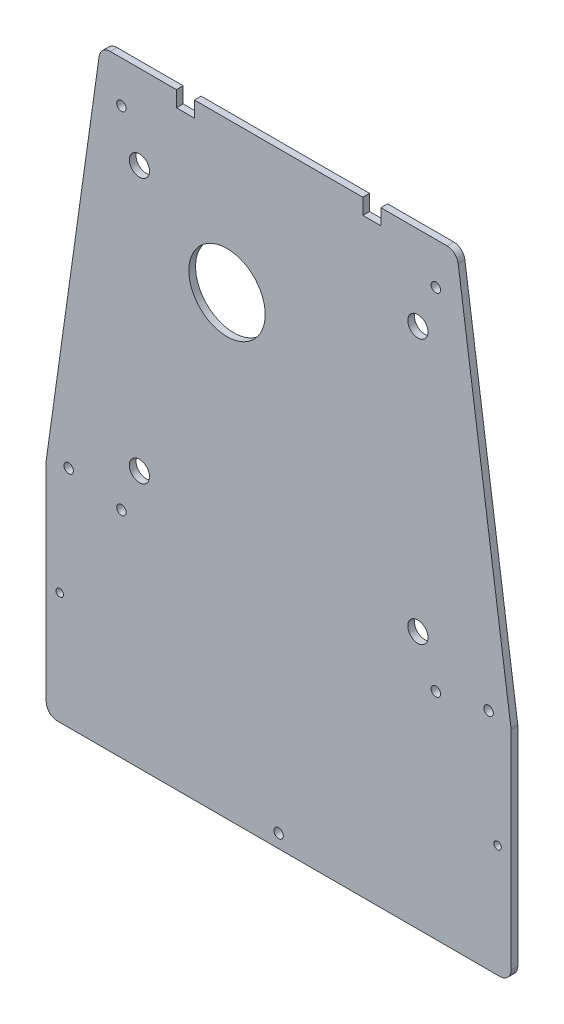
ISO-10303-21;
HEADER;
FILE_DESCRIPTION(('STEP AP214'),'2;1');
FILE_NAME('part.step','',(''),(''),'','','');
FILE_SCHEMA(('AUTOMOTIVE_DESIGN { 1 0 10303 214 1 1 1 1 }'));
ENDSEC;
DATA;
#1=APPLICATION_CONTEXT('core data for automotive mechanical design processes');
#2=APPLICATION_PROTOCOL_DEFINITION('international standard','automotive_design',2000,#1);
#3=PRODUCT_CONTEXT('',#1,'mechanical');
#4=PRODUCT('Part','Part','',(#3));
#5=PRODUCT_RELATED_PRODUCT_CATEGORY('part','',(#4));
#6=PRODUCT_DEFINITION_FORMATION('','',#4);
#7=PRODUCT_DEFINITION_CONTEXT('part definition',#1,'design');
#8=PRODUCT_DEFINITION('design','',#6,#7);
#9=PRODUCT_DEFINITION_SHAPE('','',#8);
#10=(LENGTH_UNIT() NAMED_UNIT(*) SI_UNIT(.MILLI.,.METRE.));
#11=(NAMED_UNIT(*) PLANE_ANGLE_UNIT() SI_UNIT($,.RADIAN.));
#12=(NAMED_UNIT(*) SI_UNIT($,.STERADIAN.) SOLID_ANGLE_UNIT());
#13=UNCERTAINTY_MEASURE_WITH_UNIT(LENGTH_MEASURE(1.E-05),#10,'distance_accuracy_value','');
#14=(GEOMETRIC_REPRESENTATION_CONTEXT(3) GLOBAL_UNCERTAINTY_ASSIGNED_CONTEXT((#13)) GLOBAL_UNIT_ASSIGNED_CONTEXT((#10,
#11,#12)) REPRESENTATION_CONTEXT('',''));
#15=CARTESIAN_POINT('',(0.,0.,0.));
#16=DIRECTION('',(0.,0.,1.));
#17=DIRECTION('',(1.,0.,0.));
#18=AXIS2_PLACEMENT_3D('',#15,#16,#17);
#19=CARTESIAN_POINT('',(-74.9805427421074,91.4,3.));
#20=DIRECTION('',(0.,0.,1.));
#21=DIRECTION('',(1.,0.,0.));
#22=AXIS2_PLACEMENT_3D('',#19,#20,#21);
#23=PLANE('',#22);
#24=CARTESIAN_POINT('',(-97.5,-123.6,3.));
#25=DIRECTION('',(0.,0.,1.));
#26=DIRECTION('',(1.,0.,0.));
#27=AXIS2_PLACEMENT_3D('',#24,#25,#26);
#28=CIRCLE('',#27,1.64999999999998);
#29=CARTESIAN_POINT('',(-95.85,-123.6,3.));
#30=VERTEX_POINT('',#29);
#31=EDGE_CURVE('E339',#30,#30,#28,.T.);
#32=ORIENTED_EDGE('',*,*,#31,.F.);
#33=EDGE_LOOP('',(#32));
#34=FACE_BOUND('',#33,.T.);
#35=CARTESIAN_POINT('',(97.5,-123.6,3.));
#36=DIRECTION('',(0.,0.,1.));
#37=DIRECTION('',(1.,0.,0.));
#38=AXIS2_PLACEMENT_3D('',#35,#36,#37);
#39=CIRCLE('',#38,1.64999999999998);
#40=CARTESIAN_POINT('',(99.15,-123.6,3.));
#41=VERTEX_POINT('',#40);
#42=EDGE_CURVE('E328',#41,#41,#39,.T.);
#43=ORIENTED_EDGE('',*,*,#42,.F.);
#44=EDGE_LOOP('',(#43));
#45=FACE_BOUND('',#44,.T.);
#46=CARTESIAN_POINT('',(61.9999999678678,58.8999999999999,3.));
#47=DIRECTION('',(0.,0.,1.));
#48=DIRECTION('',(-1.,0.,0.));
#49=AXIS2_PLACEMENT_3D('',#46,#47,#48);
#50=CIRCLE('',#49,4.49999999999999);
#51=CARTESIAN_POINT('',(57.4999999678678,58.8999999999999,3.));
#52=VERTEX_POINT('',#51);
#53=EDGE_CURVE('E347',#52,#52,#50,.T.);
#54=ORIENTED_EDGE('',*,*,#53,.F.);
#55=EDGE_LOOP('',(#54));
#56=FACE_BOUND('',#55,.T.);
#57=CARTESIAN_POINT('',(70.,77.9,3.));
#58=DIRECTION('',(0.,0.,1.));
#59=DIRECTION('',(-1.,0.,0.));
#60=AXIS2_PLACEMENT_3D('',#57,#58,#59);
#61=CIRCLE('',#60,2.1);
#62=CARTESIAN_POINT('',(67.9,77.9,3.));
#63=VERTEX_POINT('',#62);
#64=EDGE_CURVE('E359',#63,#63,#61,.T.);
#65=ORIENTED_EDGE('',*,*,#64,.F.);
#66=EDGE_LOOP('',(#65));
#67=FACE_BOUND('',#66,.T.);
#68=CARTESIAN_POINT('',(93.5,-73.6,3.));
#69=DIRECTION('',(0.,0.,1.));
#70=DIRECTION('',(-1.,0.,0.));
#71=AXIS2_PLACEMENT_3D('',#68,#69,#70);
#72=CIRCLE('',#71,2.1);
#73=CARTESIAN_POINT('',(91.4,-73.6,3.));
#74=VERTEX_POINT('',#73);
#75=EDGE_CURVE('E371',#74,#74,#72,.T.);
#76=ORIENTED_EDGE('',*,*,#75,.F.);
#77=EDGE_LOOP('',(#76));
#78=FACE_BOUND('',#77,.T.);
#79=CARTESIAN_POINT('',(-70.,-77.9,3.));
#80=DIRECTION('',(0.,0.,1.));
#81=DIRECTION('',(1.,0.,0.));
#82=AXIS2_PLACEMENT_3D('',#79,#80,#81);
#83=CIRCLE('',#82,2.1);
#84=CARTESIAN_POINT('',(-67.9,-77.9,3.));
#85=VERTEX_POINT('',#84);
#86=EDGE_CURVE('E383',#85,#85,#83,.T.);
#87=ORIENTED_EDGE('',*,*,#86,.F.);
#88=EDGE_LOOP('',(#87));
#89=FACE_BOUND('',#88,.T.);
#90=CARTESIAN_POINT('',(-61.9999999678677,-58.9000000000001,3.));
#91=DIRECTION('',(0.,0.,1.));
#92=DIRECTION('',(1.,0.,0.));
#93=AXIS2_PLACEMENT_3D('',#90,#91,#92);
#94=CIRCLE('',#93,4.5);
#95=CARTESIAN_POINT('',(-57.4999999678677,-58.9000000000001,3.));
#96=VERTEX_POINT('',#95);
#97=EDGE_CURVE('E395',#96,#96,#94,.T.);
#98=ORIENTED_EDGE('',*,*,#97,.F.);
#99=EDGE_LOOP('',(#98));
#100=FACE_BOUND('',#99,.T.);
#101=CARTESIAN_POINT('',(-22.994,29.4,3.));
#102=DIRECTION('',(0.,0.,1.));
#103=DIRECTION('',(1.,0.,0.));
#104=AXIS2_PLACEMENT_3D('',#101,#102,#103);
#105=CIRCLE('',#104,17.);
#106=CARTESIAN_POINT('',(-5.99400000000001,29.4,3.));
#107=VERTEX_POINT('',#106);
#108=EDGE_CURVE('E194',#107,#107,#105,.T.);
#109=ORIENTED_EDGE('',*,*,#108,.F.);
#110=EDGE_LOOP('',(#109));
#111=FACE_BOUND('',#110,.T.);
#112=CARTESIAN_POINT('',(-74.9805427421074,91.4,3.));
#113=DIRECTION('',(0.,0.,1.));
#114=DIRECTION('',(1.,0.,0.));
#115=AXIS2_PLACEMENT_3D('',#112,#113,#114);
#116=CIRCLE('',#115,5.);
#117=CARTESIAN_POINT('',(-74.9805427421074,96.4,3.));
#118=VERTEX_POINT('',#117);
#119=CARTESIAN_POINT('',(-79.9318830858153,92.0958655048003,3.));
#120=VERTEX_POINT('',#119);
#121=EDGE_CURVE('E236',#118,#120,#116,.T.);
#122=ORIENTED_EDGE('',*,*,#121,.T.);
#123=DIRECTION('',(-0.139173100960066,-0.99026806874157,0.));
#124=VECTOR('',#123,1.);
#125=CARTESIAN_POINT('',(-79.9318830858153,92.0958655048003,3.));
#126=LINE('',#125,#124);
#127=CARTESIAN_POINT('',(-103.451340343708,-75.2537685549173,3.));
#128=VERTEX_POINT('',#127);
#129=EDGE_CURVE('E189',#120,#128,#126,.T.);
#130=ORIENTED_EDGE('',*,*,#129,.T.);
#131=CARTESIAN_POINT('',(-98.5,-75.9496340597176,3.));
#132=DIRECTION('',(0.,0.,1.));
#133=DIRECTION('',(1.,0.,0.));
#134=AXIS2_PLACEMENT_3D('',#131,#132,#133);
#135=CIRCLE('',#134,5.);
#136=CARTESIAN_POINT('',(-103.5,-75.9496340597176,3.));
#137=VERTEX_POINT('',#136);
#138=EDGE_CURVE('E239',#128,#137,#135,.T.);
#139=ORIENTED_EDGE('',*,*,#138,.T.);
#140=DIRECTION('',(0.,-1.,0.));
#141=VECTOR('',#140,1.);
#142=CARTESIAN_POINT('',(-103.5,-75.9496340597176,3.));
#143=LINE('',#142,#141);
#144=CARTESIAN_POINT('',(-103.5,-168.6,3.));
#145=VERTEX_POINT('',#144);
#146=EDGE_CURVE('E241',#137,#145,#143,.T.);
#147=ORIENTED_EDGE('',*,*,#146,.T.);
#148=CARTESIAN_POINT('',(-98.5,-168.6,3.));
#149=DIRECTION('',(0.,0.,1.));
#150=DIRECTION('',(1.,0.,0.));
#151=AXIS2_PLACEMENT_3D('',#148,#149,#150);
#152=CIRCLE('',#151,5.);
#153=CARTESIAN_POINT('',(-98.5,-173.6,3.));
#154=VERTEX_POINT('',#153);
#155=EDGE_CURVE('E243',#145,#154,#152,.T.);
#156=ORIENTED_EDGE('',*,*,#155,.T.);
#157=DIRECTION('',(1.,0.,0.));
#158=VECTOR('',#157,1.);
#159=CARTESIAN_POINT('',(-98.5,-173.6,3.));
#160=LINE('',#159,#158);
#161=CARTESIAN_POINT('',(98.5,-173.6,3.));
#162=VERTEX_POINT('',#161);
#163=EDGE_CURVE('E245',#154,#162,#160,.T.);
#164=ORIENTED_EDGE('',*,*,#163,.T.);
#165=CARTESIAN_POINT('',(98.5,-168.6,3.));
#166=DIRECTION('',(0.,0.,1.));
#167=DIRECTION('',(-1.,0.,0.));
#168=AXIS2_PLACEMENT_3D('',#165,#166,#167);
#169=CIRCLE('',#168,5.);
#170=CARTESIAN_POINT('',(103.5,-168.6,3.));
#171=VERTEX_POINT('',#170);
#172=EDGE_CURVE('E247',#162,#171,#169,.T.);
#173=ORIENTED_EDGE('',*,*,#172,.T.);
#174=DIRECTION('',(0.,1.,0.));
#175=VECTOR('',#174,1.);
#176=CARTESIAN_POINT('',(103.5,-75.9496340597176,3.));
#177=LINE('',#176,#175);
#178=CARTESIAN_POINT('',(103.5,-75.9496340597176,3.));
#179=VERTEX_POINT('',#178);
#180=EDGE_CURVE('E249',#171,#179,#177,.T.);
#181=ORIENTED_EDGE('',*,*,#180,.T.);
#182=CARTESIAN_POINT('',(98.5,-75.9496340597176,3.));
#183=DIRECTION('',(0.,0.,1.));
#184=DIRECTION('',(-1.,0.,0.));
#185=AXIS2_PLACEMENT_3D('',#182,#183,#184);
#186=CIRCLE('',#185,5.);
#187=CARTESIAN_POINT('',(103.451340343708,-75.2537685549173,3.));
#188=VERTEX_POINT('',#187);
#189=EDGE_CURVE('E251',#179,#188,#186,.T.);
#190=ORIENTED_EDGE('',*,*,#189,.T.);
#191=DIRECTION('',(-0.139173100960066,0.99026806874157,0.));
#192=VECTOR('',#191,1.);
#193=CARTESIAN_POINT('',(79.9318830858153,92.0958655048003,3.));
#194=LINE('',#193,#192);
#195=CARTESIAN_POINT('',(79.9318830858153,92.0958655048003,3.));
#196=VERTEX_POINT('',#195);
#197=EDGE_CURVE('E253',#188,#196,#194,.T.);
#198=ORIENTED_EDGE('',*,*,#197,.T.);
#199=CARTESIAN_POINT('',(74.9805427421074,91.4,3.));
#200=DIRECTION('',(0.,0.,1.));
#201=DIRECTION('',(-1.,0.,0.));
#202=AXIS2_PLACEMENT_3D('',#199,#200,#201);
#203=CIRCLE('',#202,5.);
#204=CARTESIAN_POINT('',(74.9805427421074,96.4,3.));
#205=VERTEX_POINT('',#204);
#206=EDGE_CURVE('E255',#196,#205,#203,.T.);
#207=ORIENTED_EDGE('',*,*,#206,.T.);
#208=DIRECTION('',(-1.,0.,0.));
#209=VECTOR('',#208,1.);
#210=CARTESIAN_POINT('',(45.5,96.4,3.));
#211=LINE('',#210,#209);
#212=CARTESIAN_POINT('',(45.5,96.4,3.));
#213=VERTEX_POINT('',#212);
#214=EDGE_CURVE('E257',#205,#213,#211,.T.);
#215=ORIENTED_EDGE('',*,*,#214,.T.);
#216=DIRECTION('',(0.,-1.,0.));
#217=VECTOR('',#216,1.);
#218=CARTESIAN_POINT('',(45.5,96.4,3.));
#219=LINE('',#218,#217);
#220=CARTESIAN_POINT('',(45.5,89.4,3.));
#221=VERTEX_POINT('',#220);
#222=EDGE_CURVE('E259',#213,#221,#219,.T.);
#223=ORIENTED_EDGE('',*,*,#222,.T.);
#224=DIRECTION('',(-1.,0.,0.));
#225=VECTOR('',#224,1.);
#226=CARTESIAN_POINT('',(45.5,89.4,3.));
#227=LINE('',#226,#225);
#228=CARTESIAN_POINT('',(37.5,89.4,3.));
#229=VERTEX_POINT('',#228);
#230=EDGE_CURVE('E261',#221,#229,#227,.T.);
#231=ORIENTED_EDGE('',*,*,#230,.T.);
#232=DIRECTION('',(0.,1.,0.));
#233=VECTOR('',#232,1.);
#234=CARTESIAN_POINT('',(37.5,89.4,3.));
#235=LINE('',#234,#233);
#236=CARTESIAN_POINT('',(37.5,96.4,3.));
#237=VERTEX_POINT('',#236);
#238=EDGE_CURVE('E263',#229,#237,#235,.T.);
#239=ORIENTED_EDGE('',*,*,#238,.T.);
#240=DIRECTION('',(-1.,0.,0.));
#241=VECTOR('',#240,1.);
#242=CARTESIAN_POINT('',(37.5,96.4,3.));
#243=LINE('',#242,#241);
#244=CARTESIAN_POINT('',(-37.5,96.4,3.));
#245=VERTEX_POINT('',#244);
#246=EDGE_CURVE('E265',#237,#245,#243,.T.);
#247=ORIENTED_EDGE('',*,*,#246,.T.);
#248=DIRECTION('',(0.,-1.,0.));
#249=VECTOR('',#248,1.);
#250=CARTESIAN_POINT('',(-37.5,89.4,3.));
#251=LINE('',#250,#249);
#252=CARTESIAN_POINT('',(-37.5,89.4,3.));
#253=VERTEX_POINT('',#252);
#254=EDGE_CURVE('E267',#245,#253,#251,.T.);
#255=ORIENTED_EDGE('',*,*,#254,.T.);
#256=DIRECTION('',(-1.,0.,0.));
#257=VECTOR('',#256,1.);
#258=CARTESIAN_POINT('',(-45.5,89.4,3.));
#259=LINE('',#258,#257);
#260=CARTESIAN_POINT('',(-45.5,89.4,3.));
#261=VERTEX_POINT('',#260);
#262=EDGE_CURVE('E269',#253,#261,#259,.T.);
#263=ORIENTED_EDGE('',*,*,#262,.T.);
#264=DIRECTION('',(0.,1.,0.));
#265=VECTOR('',#264,1.);
#266=CARTESIAN_POINT('',(-45.5,96.4,3.));
#267=LINE('',#266,#265);
#268=CARTESIAN_POINT('',(-45.5,96.4,3.));
#269=VERTEX_POINT('',#268);
#270=EDGE_CURVE('E58',#261,#269,#267,.T.);
#271=ORIENTED_EDGE('',*,*,#270,.T.);
#272=DIRECTION('',(-1.,0.,0.));
#273=VECTOR('',#272,1.);
#274=CARTESIAN_POINT('',(-45.5,96.4,3.));
#275=LINE('',#274,#273);
#276=EDGE_CURVE('E53',#269,#118,#275,.T.);
#277=ORIENTED_EDGE('',*,*,#276,.T.);
#278=EDGE_LOOP('',(#122,#130,#139,#147,#156,#164,#173,#181,#190,#198,#207,#215,#223,#231,#239,
#247,#255,#263,#271,#277));
#279=FACE_BOUND('',#278,.T.);
#280=CARTESIAN_POINT('',(-61.9999999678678,58.8999999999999,3.));
#281=DIRECTION('',(0.,0.,1.));
#282=DIRECTION('',(1.,0.,0.));
#283=AXIS2_PLACEMENT_3D('',#280,#281,#282);
#284=CIRCLE('',#283,4.5);
#285=CARTESIAN_POINT('',(-57.4999999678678,58.8999999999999,3.));
#286=VERTEX_POINT('',#285);
#287=EDGE_CURVE('E401',#286,#286,#284,.T.);
#288=ORIENTED_EDGE('',*,*,#287,.F.);
#289=EDGE_LOOP('',(#288));
#290=FACE_BOUND('',#289,.T.);
#291=CARTESIAN_POINT('',(-70.,77.9,3.));
#292=DIRECTION('',(0.,0.,1.));
#293=DIRECTION('',(1.,0.,0.));
#294=AXIS2_PLACEMENT_3D('',#291,#292,#293);
#295=CIRCLE('',#294,2.1);
#296=CARTESIAN_POINT('',(-67.9,77.9,3.));
#297=VERTEX_POINT('',#296);
#298=EDGE_CURVE('E389',#297,#297,#295,.T.);
#299=ORIENTED_EDGE('',*,*,#298,.F.);
#300=EDGE_LOOP('',(#299));
#301=FACE_BOUND('',#300,.T.);
#302=CARTESIAN_POINT('',(-93.5,-73.6,3.));
#303=DIRECTION('',(0.,0.,1.));
#304=DIRECTION('',(1.,0.,0.));
#305=AXIS2_PLACEMENT_3D('',#302,#303,#304);
#306=CIRCLE('',#305,2.1);
#307=CARTESIAN_POINT('',(-91.4,-73.6,3.));
#308=VERTEX_POINT('',#307);
#309=EDGE_CURVE('E377',#308,#308,#306,.T.);
#310=ORIENTED_EDGE('',*,*,#309,.F.);
#311=EDGE_LOOP('',(#310));
#312=FACE_BOUND('',#311,.T.);
#313=CARTESIAN_POINT('',(70.,-77.9,3.));
#314=DIRECTION('',(0.,0.,1.));
#315=DIRECTION('',(-1.,0.,0.));
#316=AXIS2_PLACEMENT_3D('',#313,#314,#315);
#317=CIRCLE('',#316,2.1);
#318=CARTESIAN_POINT('',(67.9,-77.9,3.));
#319=VERTEX_POINT('',#318);
#320=EDGE_CURVE('E365',#319,#319,#317,.T.);
#321=ORIENTED_EDGE('',*,*,#320,.F.);
#322=EDGE_LOOP('',(#321));
#323=FACE_BOUND('',#322,.T.);
#324=CARTESIAN_POINT('',(61.9999999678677,-58.9,3.));
#325=DIRECTION('',(0.,0.,1.));
#326=DIRECTION('',(-1.,0.,0.));
#327=AXIS2_PLACEMENT_3D('',#324,#325,#326);
#328=CIRCLE('',#327,4.49999999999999);
#329=CARTESIAN_POINT('',(57.4999999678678,-58.9,3.));
#330=VERTEX_POINT('',#329);
#331=EDGE_CURVE('E353',#330,#330,#328,.T.);
#332=ORIENTED_EDGE('',*,*,#331,.F.);
#333=EDGE_LOOP('',(#332));
#334=FACE_BOUND('',#333,.T.);
#335=CARTESIAN_POINT('',(0.,-167.6,3.));
#336=DIRECTION('',(0.,0.,1.));
#337=DIRECTION('',(1.,0.,0.));
#338=AXIS2_PLACEMENT_3D('',#335,#336,#337);
#339=CIRCLE('',#338,2.09999999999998);
#340=CARTESIAN_POINT('',(2.09999999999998,-167.6,3.));
#341=VERTEX_POINT('',#340);
#342=EDGE_CURVE('E332',#341,#341,#339,.T.);
#343=ORIENTED_EDGE('',*,*,#342,.F.);
#344=EDGE_LOOP('',(#343));
#345=FACE_BOUND('',#344,.T.);
#346=ADVANCED_FACE('F36',(#34,#45,#56,#67,#78,#89,#100,#111,#279,#290,#301,#312,#323,#334,#345),
#23,.T.);
#347=CARTESIAN_POINT('',(-74.9805427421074,91.4,0.));
#348=DIRECTION('',(0.,0.,1.));
#349=DIRECTION('',(1.,0.,0.));
#350=AXIS2_PLACEMENT_3D('',#347,#348,#349);
#351=PLANE('',#350);
#352=CARTESIAN_POINT('',(-97.5,-123.6,0.));
#353=DIRECTION('',(0.,0.,1.));
#354=DIRECTION('',(1.,0.,0.));
#355=AXIS2_PLACEMENT_3D('',#352,#353,#354);
#356=CIRCLE('',#355,1.64999999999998);
#357=CARTESIAN_POINT('',(-95.85,-123.6,0.));
#358=VERTEX_POINT('',#357);
#359=EDGE_CURVE('E40',#358,#358,#356,.T.);
#360=ORIENTED_EDGE('',*,*,#359,.T.);
#361=EDGE_LOOP('',(#360));
#362=FACE_BOUND('',#361,.T.);
#363=CARTESIAN_POINT('',(97.5,-123.6,0.));
#364=DIRECTION('',(0.,0.,1.));
#365=DIRECTION('',(1.,0.,0.));
#366=AXIS2_PLACEMENT_3D('',#363,#364,#365);
#367=CIRCLE('',#366,1.64999999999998);
#368=CARTESIAN_POINT('',(99.15,-123.6,0.));
#369=VERTEX_POINT('',#368);
#370=EDGE_CURVE('E325',#369,#369,#367,.T.);
#371=ORIENTED_EDGE('',*,*,#370,.T.);
#372=EDGE_LOOP('',(#371));
#373=FACE_BOUND('',#372,.T.);
#374=CARTESIAN_POINT('',(61.9999999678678,58.8999999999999,0.));
#375=DIRECTION('',(0.,0.,1.));
#376=DIRECTION('',(-1.,0.,0.));
#377=AXIS2_PLACEMENT_3D('',#374,#375,#376);
#378=CIRCLE('',#377,4.49999999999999);
#379=CARTESIAN_POINT('',(57.4999999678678,58.8999999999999,0.));
#380=VERTEX_POINT('',#379);
#381=EDGE_CURVE('E344',#380,#380,#378,.T.);
#382=ORIENTED_EDGE('',*,*,#381,.T.);
#383=EDGE_LOOP('',(#382));
#384=FACE_BOUND('',#383,.T.);
#385=CARTESIAN_POINT('',(70.,77.9,0.));
#386=DIRECTION('',(0.,0.,1.));
#387=DIRECTION('',(-1.,0.,0.));
#388=AXIS2_PLACEMENT_3D('',#385,#386,#387);
#389=CIRCLE('',#388,2.1);
#390=CARTESIAN_POINT('',(67.9,77.9,0.));
#391=VERTEX_POINT('',#390);
#392=EDGE_CURVE('E356',#391,#391,#389,.T.);
#393=ORIENTED_EDGE('',*,*,#392,.T.);
#394=EDGE_LOOP('',(#393));
#395=FACE_BOUND('',#394,.T.);
#396=CARTESIAN_POINT('',(93.5,-73.6,0.));
#397=DIRECTION('',(0.,0.,1.));
#398=DIRECTION('',(-1.,0.,0.));
#399=AXIS2_PLACEMENT_3D('',#396,#397,#398);
#400=CIRCLE('',#399,2.1);
#401=CARTESIAN_POINT('',(91.4,-73.6,0.));
#402=VERTEX_POINT('',#401);
#403=EDGE_CURVE('E368',#402,#402,#400,.T.);
#404=ORIENTED_EDGE('',*,*,#403,.T.);
#405=EDGE_LOOP('',(#404));
#406=FACE_BOUND('',#405,.T.);
#407=CARTESIAN_POINT('',(-70.,-77.9,0.));
#408=DIRECTION('',(0.,0.,1.));
#409=DIRECTION('',(1.,0.,0.));
#410=AXIS2_PLACEMENT_3D('',#407,#408,#409);
#411=CIRCLE('',#410,2.1);
#412=CARTESIAN_POINT('',(-67.9,-77.9,0.));
#413=VERTEX_POINT('',#412);
#414=EDGE_CURVE('E380',#413,#413,#411,.T.);
#415=ORIENTED_EDGE('',*,*,#414,.T.);
#416=EDGE_LOOP('',(#415));
#417=FACE_BOUND('',#416,.T.);
#418=CARTESIAN_POINT('',(-61.9999999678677,-58.9000000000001,0.));
#419=DIRECTION('',(0.,0.,1.));
#420=DIRECTION('',(1.,0.,0.));
#421=AXIS2_PLACEMENT_3D('',#418,#419,#420);
#422=CIRCLE('',#421,4.5);
#423=CARTESIAN_POINT('',(-57.4999999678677,-58.9000000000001,0.));
#424=VERTEX_POINT('',#423);
#425=EDGE_CURVE('E392',#424,#424,#422,.T.);
#426=ORIENTED_EDGE('',*,*,#425,.T.);
#427=EDGE_LOOP('',(#426));
#428=FACE_BOUND('',#427,.T.);
#429=CARTESIAN_POINT('',(-22.994,29.4,0.));
#430=DIRECTION('',(0.,0.,1.));
#431=DIRECTION('',(1.,0.,0.));
#432=AXIS2_PLACEMENT_3D('',#429,#430,#431);
#433=CIRCLE('',#432,17.);
#434=CARTESIAN_POINT('',(-5.99400000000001,29.4,0.));
#435=VERTEX_POINT('',#434);
#436=EDGE_CURVE('E197',#435,#435,#433,.T.);
#437=ORIENTED_EDGE('',*,*,#436,.T.);
#438=EDGE_LOOP('',(#437));
#439=FACE_BOUND('',#438,.T.);
#440=CARTESIAN_POINT('',(-74.9805427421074,91.4,0.));
#441=DIRECTION('',(0.,0.,1.));
#442=DIRECTION('',(1.,0.,0.));
#443=AXIS2_PLACEMENT_3D('',#440,#441,#442);
#444=CIRCLE('',#443,5.);
#445=CARTESIAN_POINT('',(-74.9805427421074,96.4,0.));
#446=VERTEX_POINT('',#445);
#447=CARTESIAN_POINT('',(-79.9318830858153,92.0958655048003,0.));
#448=VERTEX_POINT('',#447);
#449=EDGE_CURVE('E180',#446,#448,#444,.T.);
#450=ORIENTED_EDGE('',*,*,#449,.F.);
#451=DIRECTION('',(-1.,0.,0.));
#452=VECTOR('',#451,1.);
#453=CARTESIAN_POINT('',(-45.5,96.4,0.));
#454=LINE('',#453,#452);
#455=CARTESIAN_POINT('',(-45.5,96.4,0.));
#456=VERTEX_POINT('',#455);
#457=EDGE_CURVE('E234',#456,#446,#454,.T.);
#458=ORIENTED_EDGE('',*,*,#457,.F.);
#459=DIRECTION('',(0.,1.,0.));
#460=VECTOR('',#459,1.);
#461=CARTESIAN_POINT('',(-45.5,96.4,0.));
#462=LINE('',#461,#460);
#463=CARTESIAN_POINT('',(-45.5,89.4,0.));
#464=VERTEX_POINT('',#463);
#465=EDGE_CURVE('E232',#464,#456,#462,.T.);
#466=ORIENTED_EDGE('',*,*,#465,.F.);
#467=DIRECTION('',(-1.,0.,0.));
#468=VECTOR('',#467,1.);
#469=CARTESIAN_POINT('',(-45.5,89.4,0.));
#470=LINE('',#469,#468);
#471=CARTESIAN_POINT('',(-37.5,89.4,0.));
#472=VERTEX_POINT('',#471);
#473=EDGE_CURVE('E230',#472,#464,#470,.T.);
#474=ORIENTED_EDGE('',*,*,#473,.F.);
#475=DIRECTION('',(0.,-1.,0.));
#476=VECTOR('',#475,1.);
#477=CARTESIAN_POINT('',(-37.5,89.4,0.));
#478=LINE('',#477,#476);
#479=CARTESIAN_POINT('',(-37.5,96.4,0.));
#480=VERTEX_POINT('',#479);
#481=EDGE_CURVE('E228',#480,#472,#478,.T.);
#482=ORIENTED_EDGE('',*,*,#481,.F.);
#483=DIRECTION('',(-1.,0.,0.));
#484=VECTOR('',#483,1.);
#485=CARTESIAN_POINT('',(37.5,96.4,0.));
#486=LINE('',#485,#484);
#487=CARTESIAN_POINT('',(37.5,96.4,0.));
#488=VERTEX_POINT('',#487);
#489=EDGE_CURVE('E226',#488,#480,#486,.T.);
#490=ORIENTED_EDGE('',*,*,#489,.F.);
#491=DIRECTION('',(0.,1.,0.));
#492=VECTOR('',#491,1.);
#493=CARTESIAN_POINT('',(37.5,89.4,0.));
#494=LINE('',#493,#492);
#495=CARTESIAN_POINT('',(37.5,89.4,0.));
#496=VERTEX_POINT('',#495);
#497=EDGE_CURVE('E224',#496,#488,#494,.T.);
#498=ORIENTED_EDGE('',*,*,#497,.F.);
#499=DIRECTION('',(-1.,0.,0.));
#500=VECTOR('',#499,1.);
#501=CARTESIAN_POINT('',(45.5,89.4,0.));
#502=LINE('',#501,#500);
#503=CARTESIAN_POINT('',(45.5,89.4,0.));
#504=VERTEX_POINT('',#503);
#505=EDGE_CURVE('E222',#504,#496,#502,.T.);
#506=ORIENTED_EDGE('',*,*,#505,.F.);
#507=DIRECTION('',(0.,-1.,0.));
#508=VECTOR('',#507,1.);
#509=CARTESIAN_POINT('',(45.5,96.4,0.));
#510=LINE('',#509,#508);
#511=CARTESIAN_POINT('',(45.5,96.4,0.));
#512=VERTEX_POINT('',#511);
#513=EDGE_CURVE('E220',#512,#504,#510,.T.);
#514=ORIENTED_EDGE('',*,*,#513,.F.);
#515=DIRECTION('',(-1.,0.,0.));
#516=VECTOR('',#515,1.);
#517=CARTESIAN_POINT('',(45.5,96.4,0.));
#518=LINE('',#517,#516);
#519=CARTESIAN_POINT('',(74.9805427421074,96.4,0.));
#520=VERTEX_POINT('',#519);
#521=EDGE_CURVE('E218',#520,#512,#518,.T.);
#522=ORIENTED_EDGE('',*,*,#521,.F.);
#523=CARTESIAN_POINT('',(74.9805427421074,91.4,0.));
#524=DIRECTION('',(0.,0.,1.));
#525=DIRECTION('',(-1.,0.,0.));
#526=AXIS2_PLACEMENT_3D('',#523,#524,#525);
#527=CIRCLE('',#526,5.);
#528=CARTESIAN_POINT('',(79.9318830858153,92.0958655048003,0.));
#529=VERTEX_POINT('',#528);
#530=EDGE_CURVE('E216',#529,#520,#527,.T.);
#531=ORIENTED_EDGE('',*,*,#530,.F.);
#532=DIRECTION('',(-0.139173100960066,0.99026806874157,0.));
#533=VECTOR('',#532,1.);
#534=CARTESIAN_POINT('',(79.9318830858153,92.0958655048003,0.));
#535=LINE('',#534,#533);
#536=CARTESIAN_POINT('',(103.451340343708,-75.2537685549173,0.));
#537=VERTEX_POINT('',#536);
#538=EDGE_CURVE('E214',#537,#529,#535,.T.);
#539=ORIENTED_EDGE('',*,*,#538,.F.);
#540=CARTESIAN_POINT('',(98.5,-75.9496340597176,0.));
#541=DIRECTION('',(0.,0.,1.));
#542=DIRECTION('',(-1.,0.,0.));
#543=AXIS2_PLACEMENT_3D('',#540,#541,#542);
#544=CIRCLE('',#543,5.);
#545=CARTESIAN_POINT('',(103.5,-75.9496340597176,0.));
#546=VERTEX_POINT('',#545);
#547=EDGE_CURVE('E212',#546,#537,#544,.T.);
#548=ORIENTED_EDGE('',*,*,#547,.F.);
#549=DIRECTION('',(0.,1.,0.));
#550=VECTOR('',#549,1.);
#551=CARTESIAN_POINT('',(103.5,-75.9496340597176,0.));
#552=LINE('',#551,#550);
#553=CARTESIAN_POINT('',(103.5,-168.6,0.));
#554=VERTEX_POINT('',#553);
#555=EDGE_CURVE('E210',#554,#546,#552,.T.);
#556=ORIENTED_EDGE('',*,*,#555,.F.);
#557=CARTESIAN_POINT('',(98.5,-168.6,0.));
#558=DIRECTION('',(0.,0.,1.));
#559=DIRECTION('',(-1.,0.,0.));
#560=AXIS2_PLACEMENT_3D('',#557,#558,#559);
#561=CIRCLE('',#560,5.);
#562=CARTESIAN_POINT('',(98.5,-173.6,0.));
#563=VERTEX_POINT('',#562);
#564=EDGE_CURVE('E208',#563,#554,#561,.T.);
#565=ORIENTED_EDGE('',*,*,#564,.F.);
#566=DIRECTION('',(1.,0.,0.));
#567=VECTOR('',#566,1.);
#568=CARTESIAN_POINT('',(-98.5,-173.6,0.));
#569=LINE('',#568,#567);
#570=CARTESIAN_POINT('',(-98.5,-173.6,0.));
#571=VERTEX_POINT('',#570);
#572=EDGE_CURVE('E206',#571,#563,#569,.T.);
#573=ORIENTED_EDGE('',*,*,#572,.F.);
#574=CARTESIAN_POINT('',(-98.5,-168.6,0.));
#575=DIRECTION('',(0.,0.,1.));
#576=DIRECTION('',(1.,0.,0.));
#577=AXIS2_PLACEMENT_3D('',#574,#575,#576);
#578=CIRCLE('',#577,5.);
#579=CARTESIAN_POINT('',(-103.5,-168.6,0.));
#580=VERTEX_POINT('',#579);
#581=EDGE_CURVE('E204',#580,#571,#578,.T.);
#582=ORIENTED_EDGE('',*,*,#581,.F.);
#583=DIRECTION('',(0.,-1.,0.));
#584=VECTOR('',#583,1.);
#585=CARTESIAN_POINT('',(-103.5,-75.9496340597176,0.));
#586=LINE('',#585,#584);
#587=CARTESIAN_POINT('',(-103.5,-75.9496340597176,0.));
#588=VERTEX_POINT('',#587);
#589=EDGE_CURVE('E202',#588,#580,#586,.T.);
#590=ORIENTED_EDGE('',*,*,#589,.F.);
#591=CARTESIAN_POINT('',(-98.5,-75.9496340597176,0.));
#592=DIRECTION('',(0.,0.,1.));
#593=DIRECTION('',(1.,0.,0.));
#594=AXIS2_PLACEMENT_3D('',#591,#592,#593);
#595=CIRCLE('',#594,5.);
#596=CARTESIAN_POINT('',(-103.451340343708,-75.2537685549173,0.));
#597=VERTEX_POINT('',#596);
#598=EDGE_CURVE('E182',#597,#588,#595,.T.);
#599=ORIENTED_EDGE('',*,*,#598,.F.);
#600=DIRECTION('',(-0.139173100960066,-0.99026806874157,0.));
#601=VECTOR('',#600,1.);
#602=CARTESIAN_POINT('',(-79.9318830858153,92.0958655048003,0.));
#603=LINE('',#602,#601);
#604=EDGE_CURVE('E175',#448,#597,#603,.T.);
#605=ORIENTED_EDGE('',*,*,#604,.F.);
#606=EDGE_LOOP('',(#450,#458,#466,#474,#482,#490,#498,#506,#514,#522,#531,#539,#548,#556,#565,
#573,#582,#590,#599,#605));
#607=FACE_BOUND('',#606,.T.);
#608=CARTESIAN_POINT('',(-61.9999999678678,58.8999999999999,0.));
#609=DIRECTION('',(0.,0.,1.));
#610=DIRECTION('',(1.,0.,0.));
#611=AXIS2_PLACEMENT_3D('',#608,#609,#610);
#612=CIRCLE('',#611,4.5);
#613=CARTESIAN_POINT('',(-57.4999999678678,58.8999999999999,0.));
#614=VERTEX_POINT('',#613);
#615=EDGE_CURVE('E398',#614,#614,#612,.T.);
#616=ORIENTED_EDGE('',*,*,#615,.T.);
#617=EDGE_LOOP('',(#616));
#618=FACE_BOUND('',#617,.T.);
#619=CARTESIAN_POINT('',(-70.,77.9,0.));
#620=DIRECTION('',(0.,0.,1.));
#621=DIRECTION('',(1.,0.,0.));
#622=AXIS2_PLACEMENT_3D('',#619,#620,#621);
#623=CIRCLE('',#622,2.1);
#624=CARTESIAN_POINT('',(-67.9,77.9,0.));
#625=VERTEX_POINT('',#624);
#626=EDGE_CURVE('E386',#625,#625,#623,.T.);
#627=ORIENTED_EDGE('',*,*,#626,.T.);
#628=EDGE_LOOP('',(#627));
#629=FACE_BOUND('',#628,.T.);
#630=CARTESIAN_POINT('',(-93.5,-73.6,0.));
#631=DIRECTION('',(0.,0.,1.));
#632=DIRECTION('',(1.,0.,0.));
#633=AXIS2_PLACEMENT_3D('',#630,#631,#632);
#634=CIRCLE('',#633,2.1);
#635=CARTESIAN_POINT('',(-91.4,-73.6,0.));
#636=VERTEX_POINT('',#635);
#637=EDGE_CURVE('E374',#636,#636,#634,.T.);
#638=ORIENTED_EDGE('',*,*,#637,.T.);
#639=EDGE_LOOP('',(#638));
#640=FACE_BOUND('',#639,.T.);
#641=CARTESIAN_POINT('',(70.,-77.9,0.));
#642=DIRECTION('',(0.,0.,1.));
#643=DIRECTION('',(-1.,0.,0.));
#644=AXIS2_PLACEMENT_3D('',#641,#642,#643);
#645=CIRCLE('',#644,2.1);
#646=CARTESIAN_POINT('',(67.9,-77.9,0.));
#647=VERTEX_POINT('',#646);
#648=EDGE_CURVE('E362',#647,#647,#645,.T.);
#649=ORIENTED_EDGE('',*,*,#648,.T.);
#650=EDGE_LOOP('',(#649));
#651=FACE_BOUND('',#650,.T.);
#652=CARTESIAN_POINT('',(61.9999999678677,-58.9,0.));
#653=DIRECTION('',(0.,0.,1.));
#654=DIRECTION('',(-1.,0.,0.));
#655=AXIS2_PLACEMENT_3D('',#652,#653,#654);
#656=CIRCLE('',#655,4.49999999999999);
#657=CARTESIAN_POINT('',(57.4999999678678,-58.9,0.));
#658=VERTEX_POINT('',#657);
#659=EDGE_CURVE('E350',#658,#658,#656,.T.);
#660=ORIENTED_EDGE('',*,*,#659,.T.);
#661=EDGE_LOOP('',(#660));
#662=FACE_BOUND('',#661,.T.);
#663=CARTESIAN_POINT('',(0.,-167.6,0.));
#664=DIRECTION('',(0.,0.,1.));
#665=DIRECTION('',(1.,0.,0.));
#666=AXIS2_PLACEMENT_3D('',#663,#664,#665);
#667=CIRCLE('',#666,2.09999999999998);
#668=CARTESIAN_POINT('',(2.09999999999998,-167.6,0.));
#669=VERTEX_POINT('',#668);
#670=EDGE_CURVE('E327',#669,#669,#667,.T.);
#671=ORIENTED_EDGE('',*,*,#670,.T.);
#672=EDGE_LOOP('',(#671));
#673=FACE_BOUND('',#672,.T.);
#674=ADVANCED_FACE('F176',(#362,#373,#384,#395,#406,#417,#428,#439,#607,#618,#629,#640,#651,
#662,#673),#351,.F.);
#675=CARTESIAN_POINT('',(-74.9805427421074,91.4,3.));
#676=DIRECTION('',(0.,0.,-1.));
#677=DIRECTION('',(-1.,0.,0.));
#678=AXIS2_PLACEMENT_3D('',#675,#676,#677);
#679=CYLINDRICAL_SURFACE('',#678,5.);
#680=ORIENTED_EDGE('',*,*,#449,.T.);
#681=DIRECTION('',(0.,0.,-1.));
#682=VECTOR('',#681,1.);
#683=CARTESIAN_POINT('',(-79.9318830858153,92.0958655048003,3.));
#684=LINE('',#683,#682);
#685=EDGE_CURVE('E11',#120,#448,#684,.T.);
#686=ORIENTED_EDGE('',*,*,#685,.F.);
#687=ORIENTED_EDGE('',*,*,#121,.F.);
#688=DIRECTION('',(0.,0.,-1.));
#689=VECTOR('',#688,1.);
#690=CARTESIAN_POINT('',(-74.9805427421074,96.4,3.));
#691=LINE('',#690,#689);
#692=EDGE_CURVE('E193',#118,#446,#691,.T.);
#693=ORIENTED_EDGE('',*,*,#692,.T.);
#694=EDGE_LOOP('',(#680,#686,#687,#693));
#695=FACE_BOUND('',#694,.T.);
#696=ADVANCED_FACE('F38',(#695),#679,.T.);
#697=CARTESIAN_POINT('',(-79.9318830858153,92.0958655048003,3.));
#698=DIRECTION('',(0.99026806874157,-0.139173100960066,0.));
#699=DIRECTION('',(0.139173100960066,0.99026806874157,0.));
#700=AXIS2_PLACEMENT_3D('',#697,#698,#699);
#701=PLANE('',#700);
#702=ORIENTED_EDGE('',*,*,#604,.T.);
#703=DIRECTION('',(0.,0.,-1.));
#704=VECTOR('',#703,1.);
#705=CARTESIAN_POINT('',(-103.451340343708,-75.2537685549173,3.));
#706=LINE('',#705,#704);
#707=EDGE_CURVE('E45',#128,#597,#706,.T.);
#708=ORIENTED_EDGE('',*,*,#707,.F.);
#709=ORIENTED_EDGE('',*,*,#129,.F.);
#710=ORIENTED_EDGE('',*,*,#685,.T.);
#711=EDGE_LOOP('',(#702,#708,#709,#710));
#712=FACE_BOUND('',#711,.T.);
#713=ADVANCED_FACE('F188',(#712),#701,.F.);
#714=CARTESIAN_POINT('',(-98.5,-75.9496340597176,3.));
#715=DIRECTION('',(0.,0.,-1.));
#716=DIRECTION('',(-1.,0.,0.));
#717=AXIS2_PLACEMENT_3D('',#714,#715,#716);
#718=CYLINDRICAL_SURFACE('',#717,5.);
#719=ORIENTED_EDGE('',*,*,#598,.T.);
#720=DIRECTION('',(0.,0.,-1.));
#721=VECTOR('',#720,1.);
#722=CARTESIAN_POINT('',(-103.5,-75.9496340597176,3.));
#723=LINE('',#722,#721);
#724=EDGE_CURVE('E322',#137,#588,#723,.T.);
#725=ORIENTED_EDGE('',*,*,#724,.F.);
#726=ORIENTED_EDGE('',*,*,#138,.F.);
#727=ORIENTED_EDGE('',*,*,#707,.T.);
#728=EDGE_LOOP('',(#719,#725,#726,#727));
#729=FACE_BOUND('',#728,.T.);
#730=ADVANCED_FACE('F496',(#729),#718,.T.);
#731=CARTESIAN_POINT('',(-103.5,-75.9496340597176,3.));
#732=DIRECTION('',(1.,0.,0.));
#733=DIRECTION('',(0.,1.,0.));
#734=AXIS2_PLACEMENT_3D('',#731,#732,#733);
#735=PLANE('',#734);
#736=ORIENTED_EDGE('',*,*,#589,.T.);
#737=DIRECTION('',(0.,0.,-1.));
#738=VECTOR('',#737,1.);
#739=CARTESIAN_POINT('',(-103.5,-168.6,3.));
#740=LINE('',#739,#738);
#741=EDGE_CURVE('E319',#145,#580,#740,.T.);
#742=ORIENTED_EDGE('',*,*,#741,.F.);
#743=ORIENTED_EDGE('',*,*,#146,.F.);
#744=ORIENTED_EDGE('',*,*,#724,.T.);
#745=EDGE_LOOP('',(#736,#742,#743,#744));
#746=FACE_BOUND('',#745,.T.);
#747=ADVANCED_FACE('F492',(#746),#735,.F.);
#748=CARTESIAN_POINT('',(-98.5,-168.6,3.));
#749=DIRECTION('',(0.,0.,-1.));
#750=DIRECTION('',(-1.,0.,0.));
#751=AXIS2_PLACEMENT_3D('',#748,#749,#750);
#752=CYLINDRICAL_SURFACE('',#751,5.);
#753=ORIENTED_EDGE('',*,*,#581,.T.);
#754=DIRECTION('',(0.,0.,-1.));
#755=VECTOR('',#754,1.);
#756=CARTESIAN_POINT('',(-98.5,-173.6,3.));
#757=LINE('',#756,#755);
#758=EDGE_CURVE('E316',#154,#571,#757,.T.);
#759=ORIENTED_EDGE('',*,*,#758,.F.);
#760=ORIENTED_EDGE('',*,*,#155,.F.);
#761=ORIENTED_EDGE('',*,*,#741,.T.);
#762=EDGE_LOOP('',(#753,#759,#760,#761));
#763=FACE_BOUND('',#762,.T.);
#764=ADVANCED_FACE('F488',(#763),#752,.T.);
#765=CARTESIAN_POINT('',(-98.5,-173.6,3.));
#766=DIRECTION('',(0.,1.,0.));
#767=DIRECTION('',(-1.,0.,0.));
#768=AXIS2_PLACEMENT_3D('',#765,#766,#767);
#769=PLANE('',#768);
#770=ORIENTED_EDGE('',*,*,#572,.T.);
#771=DIRECTION('',(0.,0.,-1.));
#772=VECTOR('',#771,1.);
#773=CARTESIAN_POINT('',(98.5,-173.6,3.));
#774=LINE('',#773,#772);
#775=EDGE_CURVE('E313',#162,#563,#774,.T.);
#776=ORIENTED_EDGE('',*,*,#775,.F.);
#777=ORIENTED_EDGE('',*,*,#163,.F.);
#778=ORIENTED_EDGE('',*,*,#758,.T.);
#779=EDGE_LOOP('',(#770,#776,#777,#778));
#780=FACE_BOUND('',#779,.T.);
#781=ADVANCED_FACE('F484',(#780),#769,.F.);
#782=CARTESIAN_POINT('',(98.5,-168.6,3.));
#783=DIRECTION('',(0.,0.,-1.));
#784=DIRECTION('',(-1.,0.,0.));
#785=AXIS2_PLACEMENT_3D('',#782,#783,#784);
#786=CYLINDRICAL_SURFACE('',#785,5.);
#787=ORIENTED_EDGE('',*,*,#564,.T.);
#788=DIRECTION('',(0.,0.,-1.));
#789=VECTOR('',#788,1.);
#790=CARTESIAN_POINT('',(103.5,-168.6,3.));
#791=LINE('',#790,#789);
#792=EDGE_CURVE('E310',#171,#554,#791,.T.);
#793=ORIENTED_EDGE('',*,*,#792,.F.);
#794=ORIENTED_EDGE('',*,*,#172,.F.);
#795=ORIENTED_EDGE('',*,*,#775,.T.);
#796=EDGE_LOOP('',(#787,#793,#794,#795));
#797=FACE_BOUND('',#796,.T.);
#798=ADVANCED_FACE('F480',(#797),#786,.T.);
#799=CARTESIAN_POINT('',(103.5,-75.9496340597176,3.));
#800=DIRECTION('',(-1.,0.,0.));
#801=DIRECTION('',(0.,-1.,0.));
#802=AXIS2_PLACEMENT_3D('',#799,#800,#801);
#803=PLANE('',#802);
#804=ORIENTED_EDGE('',*,*,#555,.T.);
#805=DIRECTION('',(0.,0.,-1.));
#806=VECTOR('',#805,1.);
#807=CARTESIAN_POINT('',(103.5,-75.9496340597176,3.));
#808=LINE('',#807,#806);
#809=EDGE_CURVE('E307',#179,#546,#808,.T.);
#810=ORIENTED_EDGE('',*,*,#809,.F.);
#811=ORIENTED_EDGE('',*,*,#180,.F.);
#812=ORIENTED_EDGE('',*,*,#792,.T.);
#813=EDGE_LOOP('',(#804,#810,#811,#812));
#814=FACE_BOUND('',#813,.T.);
#815=ADVANCED_FACE('F476',(#814),#803,.F.);
#816=CARTESIAN_POINT('',(98.5,-75.9496340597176,3.));
#817=DIRECTION('',(0.,0.,-1.));
#818=DIRECTION('',(-1.,0.,0.));
#819=AXIS2_PLACEMENT_3D('',#816,#817,#818);
#820=CYLINDRICAL_SURFACE('',#819,5.);
#821=ORIENTED_EDGE('',*,*,#547,.T.);
#822=DIRECTION('',(0.,0.,-1.));
#823=VECTOR('',#822,1.);
#824=CARTESIAN_POINT('',(103.451340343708,-75.2537685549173,3.));
#825=LINE('',#824,#823);
#826=EDGE_CURVE('E304',#188,#537,#825,.T.);
#827=ORIENTED_EDGE('',*,*,#826,.F.);
#828=ORIENTED_EDGE('',*,*,#189,.F.);
#829=ORIENTED_EDGE('',*,*,#809,.T.);
#830=EDGE_LOOP('',(#821,#827,#828,#829));
#831=FACE_BOUND('',#830,.T.);
#832=ADVANCED_FACE('F472',(#831),#820,.T.);
#833=CARTESIAN_POINT('',(79.9318830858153,92.0958655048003,3.));
#834=DIRECTION('',(-0.99026806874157,-0.139173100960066,0.));
#835=DIRECTION('',(0.139173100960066,-0.99026806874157,0.));
#836=AXIS2_PLACEMENT_3D('',#833,#834,#835);
#837=PLANE('',#836);
#838=ORIENTED_EDGE('',*,*,#538,.T.);
#839=DIRECTION('',(0.,0.,-1.));
#840=VECTOR('',#839,1.);
#841=CARTESIAN_POINT('',(79.9318830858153,92.0958655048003,3.));
#842=LINE('',#841,#840);
#843=EDGE_CURVE('E301',#196,#529,#842,.T.);
#844=ORIENTED_EDGE('',*,*,#843,.F.);
#845=ORIENTED_EDGE('',*,*,#197,.F.);
#846=ORIENTED_EDGE('',*,*,#826,.T.);
#847=EDGE_LOOP('',(#838,#844,#845,#846));
#848=FACE_BOUND('',#847,.T.);
#849=ADVANCED_FACE('F468',(#848),#837,.F.);
#850=CARTESIAN_POINT('',(74.9805427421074,91.4,3.));
#851=DIRECTION('',(0.,0.,-1.));
#852=DIRECTION('',(-1.,0.,0.));
#853=AXIS2_PLACEMENT_3D('',#850,#851,#852);
#854=CYLINDRICAL_SURFACE('',#853,5.);
#855=ORIENTED_EDGE('',*,*,#530,.T.);
#856=DIRECTION('',(0.,0.,-1.));
#857=VECTOR('',#856,1.);
#858=CARTESIAN_POINT('',(74.9805427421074,96.4,3.));
#859=LINE('',#858,#857);
#860=EDGE_CURVE('E298',#205,#520,#859,.T.);
#861=ORIENTED_EDGE('',*,*,#860,.F.);
#862=ORIENTED_EDGE('',*,*,#206,.F.);
#863=ORIENTED_EDGE('',*,*,#843,.T.);
#864=EDGE_LOOP('',(#855,#861,#862,#863));
#865=FACE_BOUND('',#864,.T.);
#866=ADVANCED_FACE('F464',(#865),#854,.T.);
#867=CARTESIAN_POINT('',(45.5,96.4,3.));
#868=DIRECTION('',(0.,-1.,0.));
#869=DIRECTION('',(1.,0.,0.));
#870=AXIS2_PLACEMENT_3D('',#867,#868,#869);
#871=PLANE('',#870);
#872=ORIENTED_EDGE('',*,*,#521,.T.);
#873=DIRECTION('',(0.,0.,-1.));
#874=VECTOR('',#873,1.);
#875=CARTESIAN_POINT('',(45.5,96.4,3.));
#876=LINE('',#875,#874);
#877=EDGE_CURVE('E295',#213,#512,#876,.T.);
#878=ORIENTED_EDGE('',*,*,#877,.F.);
#879=ORIENTED_EDGE('',*,*,#214,.F.);
#880=ORIENTED_EDGE('',*,*,#860,.T.);
#881=EDGE_LOOP('',(#872,#878,#879,#880));
#882=FACE_BOUND('',#881,.T.);
#883=ADVANCED_FACE('F460',(#882),#871,.F.);
#884=CARTESIAN_POINT('',(45.5,96.4,3.));
#885=DIRECTION('',(1.,0.,0.));
#886=DIRECTION('',(0.,0.,-1.));
#887=AXIS2_PLACEMENT_3D('',#884,#885,#886);
#888=PLANE('',#887);
#889=ORIENTED_EDGE('',*,*,#513,.T.);
#890=DIRECTION('',(0.,0.,-1.));
#891=VECTOR('',#890,1.);
#892=CARTESIAN_POINT('',(45.5,89.4,3.));
#893=LINE('',#892,#891);
#894=EDGE_CURVE('E292',#221,#504,#893,.T.);
#895=ORIENTED_EDGE('',*,*,#894,.F.);
#896=ORIENTED_EDGE('',*,*,#222,.F.);
#897=ORIENTED_EDGE('',*,*,#877,.T.);
#898=EDGE_LOOP('',(#889,#895,#896,#897));
#899=FACE_BOUND('',#898,.T.);
#900=ADVANCED_FACE('F456',(#899),#888,.F.);
#901=CARTESIAN_POINT('',(45.5,89.4,3.));
#902=DIRECTION('',(0.,-1.,0.));
#903=DIRECTION('',(0.,0.,-1.));
#904=AXIS2_PLACEMENT_3D('',#901,#902,#903);
#905=PLANE('',#904);
#906=ORIENTED_EDGE('',*,*,#505,.T.);
#907=DIRECTION('',(0.,0.,-1.));
#908=VECTOR('',#907,1.);
#909=CARTESIAN_POINT('',(37.5,89.4,3.));
#910=LINE('',#909,#908);
#911=EDGE_CURVE('E289',#229,#496,#910,.T.);
#912=ORIENTED_EDGE('',*,*,#911,.F.);
#913=ORIENTED_EDGE('',*,*,#230,.F.);
#914=ORIENTED_EDGE('',*,*,#894,.T.);
#915=EDGE_LOOP('',(#906,#912,#913,#914));
#916=FACE_BOUND('',#915,.T.);
#917=ADVANCED_FACE('F452',(#916),#905,.F.);
#918=CARTESIAN_POINT('',(37.5,89.4,3.));
#919=DIRECTION('',(-1.,0.,0.));
#920=DIRECTION('',(0.,0.,1.));
#921=AXIS2_PLACEMENT_3D('',#918,#919,#920);
#922=PLANE('',#921);
#923=ORIENTED_EDGE('',*,*,#497,.T.);
#924=DIRECTION('',(0.,0.,-1.));
#925=VECTOR('',#924,1.);
#926=CARTESIAN_POINT('',(37.5,96.4,3.));
#927=LINE('',#926,#925);
#928=EDGE_CURVE('E286',#237,#488,#927,.T.);
#929=ORIENTED_EDGE('',*,*,#928,.F.);
#930=ORIENTED_EDGE('',*,*,#238,.F.);
#931=ORIENTED_EDGE('',*,*,#911,.T.);
#932=EDGE_LOOP('',(#923,#929,#930,#931));
#933=FACE_BOUND('',#932,.T.);
#934=ADVANCED_FACE('F448',(#933),#922,.F.);
#935=CARTESIAN_POINT('',(37.5,96.4,3.));
#936=DIRECTION('',(0.,-1.,0.));
#937=DIRECTION('',(0.,0.,-1.));
#938=AXIS2_PLACEMENT_3D('',#935,#936,#937);
#939=PLANE('',#938);
#940=ORIENTED_EDGE('',*,*,#489,.T.);
#941=DIRECTION('',(0.,0.,-1.));
#942=VECTOR('',#941,1.);
#943=CARTESIAN_POINT('',(-37.5,96.4,3.));
#944=LINE('',#943,#942);
#945=EDGE_CURVE('E283',#245,#480,#944,.T.);
#946=ORIENTED_EDGE('',*,*,#945,.F.);
#947=ORIENTED_EDGE('',*,*,#246,.F.);
#948=ORIENTED_EDGE('',*,*,#928,.T.);
#949=EDGE_LOOP('',(#940,#946,#947,#948));
#950=FACE_BOUND('',#949,.T.);
#951=ADVANCED_FACE('F444',(#950),#939,.F.);
#952=CARTESIAN_POINT('',(-37.5,89.4,3.));
#953=DIRECTION('',(1.,0.,0.));
#954=DIRECTION('',(0.,0.,-1.));
#955=AXIS2_PLACEMENT_3D('',#952,#953,#954);
#956=PLANE('',#955);
#957=ORIENTED_EDGE('',*,*,#481,.T.);
#958=DIRECTION('',(0.,0.,-1.));
#959=VECTOR('',#958,1.);
#960=CARTESIAN_POINT('',(-37.5,89.4,3.));
#961=LINE('',#960,#959);
#962=EDGE_CURVE('E280',#253,#472,#961,.T.);
#963=ORIENTED_EDGE('',*,*,#962,.F.);
#964=ORIENTED_EDGE('',*,*,#254,.F.);
#965=ORIENTED_EDGE('',*,*,#945,.T.);
#966=EDGE_LOOP('',(#957,#963,#964,#965));
#967=FACE_BOUND('',#966,.T.);
#968=ADVANCED_FACE('F440',(#967),#956,.F.);
#969=CARTESIAN_POINT('',(-45.5,89.4,3.));
#970=DIRECTION('',(0.,-1.,0.));
#971=DIRECTION('',(0.,0.,-1.));
#972=AXIS2_PLACEMENT_3D('',#969,#970,#971);
#973=PLANE('',#972);
#974=ORIENTED_EDGE('',*,*,#473,.T.);
#975=DIRECTION('',(0.,0.,-1.));
#976=VECTOR('',#975,1.);
#977=CARTESIAN_POINT('',(-45.5,89.4,3.));
#978=LINE('',#977,#976);
#979=EDGE_CURVE('E277',#261,#464,#978,.T.);
#980=ORIENTED_EDGE('',*,*,#979,.F.);
#981=ORIENTED_EDGE('',*,*,#262,.F.);
#982=ORIENTED_EDGE('',*,*,#962,.T.);
#983=EDGE_LOOP('',(#974,#980,#981,#982));
#984=FACE_BOUND('',#983,.T.);
#985=ADVANCED_FACE('F436',(#984),#973,.F.);
#986=CARTESIAN_POINT('',(-45.5,96.4,3.));
#987=DIRECTION('',(-1.,0.,0.));
#988=DIRECTION('',(0.,0.,1.));
#989=AXIS2_PLACEMENT_3D('',#986,#987,#988);
#990=PLANE('',#989);
#991=ORIENTED_EDGE('',*,*,#465,.T.);
#992=DIRECTION('',(0.,0.,-1.));
#993=VECTOR('',#992,1.);
#994=CARTESIAN_POINT('',(-45.5,96.4,3.));
#995=LINE('',#994,#993);
#996=EDGE_CURVE('E274',#269,#456,#995,.T.);
#997=ORIENTED_EDGE('',*,*,#996,.F.);
#998=ORIENTED_EDGE('',*,*,#270,.F.);
#999=ORIENTED_EDGE('',*,*,#979,.T.);
#1000=EDGE_LOOP('',(#991,#997,#998,#999));
#1001=FACE_BOUND('',#1000,.T.);
#1002=ADVANCED_FACE('F420',(#1001),#990,.F.);
#1003=CARTESIAN_POINT('',(-45.5,96.4,3.));
#1004=DIRECTION('',(0.,-1.,0.));
#1005=DIRECTION('',(1.,0.,0.));
#1006=AXIS2_PLACEMENT_3D('',#1003,#1004,#1005);
#1007=PLANE('',#1006);
#1008=ORIENTED_EDGE('',*,*,#457,.T.);
#1009=ORIENTED_EDGE('',*,*,#692,.F.);
#1010=ORIENTED_EDGE('',*,*,#276,.F.);
#1011=ORIENTED_EDGE('',*,*,#996,.T.);
#1012=EDGE_LOOP('',(#1008,#1009,#1010,#1011));
#1013=FACE_BOUND('',#1012,.T.);
#1014=ADVANCED_FACE('F410',(#1013),#1007,.F.);
#1015=CARTESIAN_POINT('',(-22.994,29.4,3.));
#1016=DIRECTION('',(0.,0.,-1.));
#1017=DIRECTION('',(-1.,0.,0.));
#1018=AXIS2_PLACEMENT_3D('',#1015,#1016,#1017);
#1019=CYLINDRICAL_SURFACE('',#1018,17.);
#1020=ORIENTED_EDGE('',*,*,#108,.T.);
#1021=EDGE_LOOP('',(#1020));
#1022=FACE_BOUND('',#1021,.T.);
#1023=ORIENTED_EDGE('',*,*,#436,.F.);
#1024=EDGE_LOOP('',(#1023));
#1025=FACE_BOUND('',#1024,.T.);
#1026=ADVANCED_FACE('F407',(#1022,#1025),#1019,.F.);
#1027=CARTESIAN_POINT('',(-61.9999999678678,58.8999999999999,3.));
#1028=DIRECTION('',(0.,0.,-1.));
#1029=DIRECTION('',(-1.,0.,0.));
#1030=AXIS2_PLACEMENT_3D('',#1027,#1028,#1029);
#1031=CYLINDRICAL_SURFACE('',#1030,4.5);
#1032=ORIENTED_EDGE('',*,*,#287,.T.);
#1033=EDGE_LOOP('',(#1032));
#1034=FACE_BOUND('',#1033,.T.);
#1035=ORIENTED_EDGE('',*,*,#615,.F.);
#1036=EDGE_LOOP('',(#1035));
#1037=FACE_BOUND('',#1036,.T.);
#1038=ADVANCED_FACE('F409',(#1034,#1037),#1031,.F.);
#1039=CARTESIAN_POINT('',(-61.9999999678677,-58.9000000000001,3.));
#1040=DIRECTION('',(0.,0.,-1.));
#1041=DIRECTION('',(-1.,0.,0.));
#1042=AXIS2_PLACEMENT_3D('',#1039,#1040,#1041);
#1043=CYLINDRICAL_SURFACE('',#1042,4.5);
#1044=ORIENTED_EDGE('',*,*,#97,.T.);
#1045=EDGE_LOOP('',(#1044));
#1046=FACE_BOUND('',#1045,.T.);
#1047=ORIENTED_EDGE('',*,*,#425,.F.);
#1048=EDGE_LOOP('',(#1047));
#1049=FACE_BOUND('',#1048,.T.);
#1050=ADVANCED_FACE('F417',(#1046,#1049),#1043,.F.);
#1051=CARTESIAN_POINT('',(-70.,77.9,3.));
#1052=DIRECTION('',(0.,0.,-1.));
#1053=DIRECTION('',(-1.,0.,0.));
#1054=AXIS2_PLACEMENT_3D('',#1051,#1052,#1053);
#1055=CYLINDRICAL_SURFACE('',#1054,2.1);
#1056=ORIENTED_EDGE('',*,*,#298,.T.);
#1057=EDGE_LOOP('',(#1056));
#1058=FACE_BOUND('',#1057,.T.);
#1059=ORIENTED_EDGE('',*,*,#626,.F.);
#1060=EDGE_LOOP('',(#1059));
#1061=FACE_BOUND('',#1060,.T.);
#1062=ADVANCED_FACE('F600',(#1058,#1061),#1055,.F.);
#1063=CARTESIAN_POINT('',(-70.,-77.9,3.));
#1064=DIRECTION('',(0.,0.,-1.));
#1065=DIRECTION('',(-1.,0.,0.));
#1066=AXIS2_PLACEMENT_3D('',#1063,#1064,#1065);
#1067=CYLINDRICAL_SURFACE('',#1066,2.1);
#1068=ORIENTED_EDGE('',*,*,#86,.T.);
#1069=EDGE_LOOP('',(#1068));
#1070=FACE_BOUND('',#1069,.T.);
#1071=ORIENTED_EDGE('',*,*,#414,.F.);
#1072=EDGE_LOOP('',(#1071));
#1073=FACE_BOUND('',#1072,.T.);
#1074=ADVANCED_FACE('F592',(#1070,#1073),#1067,.F.);
#1075=CARTESIAN_POINT('',(-93.5,-73.6,3.));
#1076=DIRECTION('',(0.,0.,-1.));
#1077=DIRECTION('',(-1.,0.,0.));
#1078=AXIS2_PLACEMENT_3D('',#1075,#1076,#1077);
#1079=CYLINDRICAL_SURFACE('',#1078,2.1);
#1080=ORIENTED_EDGE('',*,*,#309,.T.);
#1081=EDGE_LOOP('',(#1080));
#1082=FACE_BOUND('',#1081,.T.);
#1083=ORIENTED_EDGE('',*,*,#637,.F.);
#1084=EDGE_LOOP('',(#1083));
#1085=FACE_BOUND('',#1084,.T.);
#1086=ADVANCED_FACE('F584',(#1082,#1085),#1079,.F.);
#1087=CARTESIAN_POINT('',(93.5,-73.6,3.));
#1088=DIRECTION('',(0.,0.,-1.));
#1089=DIRECTION('',(-1.,0.,0.));
#1090=AXIS2_PLACEMENT_3D('',#1087,#1088,#1089);
#1091=CYLINDRICAL_SURFACE('',#1090,2.1);
#1092=ORIENTED_EDGE('',*,*,#75,.T.);
#1093=EDGE_LOOP('',(#1092));
#1094=FACE_BOUND('',#1093,.T.);
#1095=ORIENTED_EDGE('',*,*,#403,.F.);
#1096=EDGE_LOOP('',(#1095));
#1097=FACE_BOUND('',#1096,.T.);
#1098=ADVANCED_FACE('F576',(#1094,#1097),#1091,.F.);
#1099=CARTESIAN_POINT('',(70.,-77.9,3.));
#1100=DIRECTION('',(0.,0.,-1.));
#1101=DIRECTION('',(-1.,0.,0.));
#1102=AXIS2_PLACEMENT_3D('',#1099,#1100,#1101);
#1103=CYLINDRICAL_SURFACE('',#1102,2.1);
#1104=ORIENTED_EDGE('',*,*,#320,.T.);
#1105=EDGE_LOOP('',(#1104));
#1106=FACE_BOUND('',#1105,.T.);
#1107=ORIENTED_EDGE('',*,*,#648,.F.);
#1108=EDGE_LOOP('',(#1107));
#1109=FACE_BOUND('',#1108,.T.);
#1110=ADVANCED_FACE('F568',(#1106,#1109),#1103,.F.);
#1111=CARTESIAN_POINT('',(70.,77.9,3.));
#1112=DIRECTION('',(0.,0.,-1.));
#1113=DIRECTION('',(-1.,0.,0.));
#1114=AXIS2_PLACEMENT_3D('',#1111,#1112,#1113);
#1115=CYLINDRICAL_SURFACE('',#1114,2.1);
#1116=ORIENTED_EDGE('',*,*,#64,.T.);
#1117=EDGE_LOOP('',(#1116));
#1118=FACE_BOUND('',#1117,.T.);
#1119=ORIENTED_EDGE('',*,*,#392,.F.);
#1120=EDGE_LOOP('',(#1119));
#1121=FACE_BOUND('',#1120,.T.);
#1122=ADVANCED_FACE('F560',(#1118,#1121),#1115,.F.);
#1123=CARTESIAN_POINT('',(61.9999999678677,-58.9,3.));
#1124=DIRECTION('',(0.,0.,-1.));
#1125=DIRECTION('',(-1.,0.,0.));
#1126=AXIS2_PLACEMENT_3D('',#1123,#1124,#1125);
#1127=CYLINDRICAL_SURFACE('',#1126,4.49999999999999);
#1128=ORIENTED_EDGE('',*,*,#331,.T.);
#1129=EDGE_LOOP('',(#1128));
#1130=FACE_BOUND('',#1129,.T.);
#1131=ORIENTED_EDGE('',*,*,#659,.F.);
#1132=EDGE_LOOP('',(#1131));
#1133=FACE_BOUND('',#1132,.T.);
#1134=ADVANCED_FACE('F552',(#1130,#1133),#1127,.F.);
#1135=CARTESIAN_POINT('',(61.9999999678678,58.8999999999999,3.));
#1136=DIRECTION('',(0.,0.,-1.));
#1137=DIRECTION('',(-1.,0.,0.));
#1138=AXIS2_PLACEMENT_3D('',#1135,#1136,#1137);
#1139=CYLINDRICAL_SURFACE('',#1138,4.49999999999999);
#1140=ORIENTED_EDGE('',*,*,#53,.T.);
#1141=EDGE_LOOP('',(#1140));
#1142=FACE_BOUND('',#1141,.T.);
#1143=ORIENTED_EDGE('',*,*,#381,.F.);
#1144=EDGE_LOOP('',(#1143));
#1145=FACE_BOUND('',#1144,.T.);
#1146=ADVANCED_FACE('F545',(#1142,#1145),#1139,.F.);
#1147=CARTESIAN_POINT('',(0.,-167.6,3.));
#1148=DIRECTION('',(0.,0.,-1.));
#1149=DIRECTION('',(-1.,0.,0.));
#1150=AXIS2_PLACEMENT_3D('',#1147,#1148,#1149);
#1151=CYLINDRICAL_SURFACE('',#1150,2.09999999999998);
#1152=ORIENTED_EDGE('',*,*,#342,.T.);
#1153=EDGE_LOOP('',(#1152));
#1154=FACE_BOUND('',#1153,.T.);
#1155=ORIENTED_EDGE('',*,*,#670,.F.);
#1156=EDGE_LOOP('',(#1155));
#1157=FACE_BOUND('',#1156,.T.);
#1158=ADVANCED_FACE('F525',(#1154,#1157),#1151,.F.);
#1159=CARTESIAN_POINT('',(97.5,-123.6,3.));
#1160=DIRECTION('',(0.,0.,1.));
#1161=DIRECTION('',(1.,0.,0.));
#1162=AXIS2_PLACEMENT_3D('',#1159,#1160,#1161);
#1163=CYLINDRICAL_SURFACE('',#1162,1.64999999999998);
#1164=ORIENTED_EDGE('',*,*,#42,.T.);
#1165=EDGE_LOOP('',(#1164));
#1166=FACE_BOUND('',#1165,.T.);
#1167=ORIENTED_EDGE('',*,*,#370,.F.);
#1168=EDGE_LOOP('',(#1167));
#1169=FACE_BOUND('',#1168,.T.);
#1170=ADVANCED_FACE('F518',(#1166,#1169),#1163,.F.);
#1171=CARTESIAN_POINT('',(-97.5,-123.6,3.));
#1172=DIRECTION('',(0.,0.,1.));
#1173=DIRECTION('',(1.,0.,0.));
#1174=AXIS2_PLACEMENT_3D('',#1171,#1172,#1173);
#1175=CYLINDRICAL_SURFACE('',#1174,1.64999999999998);
#1176=ORIENTED_EDGE('',*,*,#31,.T.);
#1177=EDGE_LOOP('',(#1176));
#1178=FACE_BOUND('',#1177,.T.);
#1179=ORIENTED_EDGE('',*,*,#359,.F.);
#1180=EDGE_LOOP('',(#1179));
#1181=FACE_BOUND('',#1180,.T.);
#1182=ADVANCED_FACE('F524',(#1178,#1181),#1175,.F.);
#1183=CLOSED_SHELL('',(#346,#674,#696,#713,#730,#747,#764,#781,#798,#815,#832,#849,#866,#883,
#900,#917,#934,#951,#968,#985,#1002,#1014,#1026,#1038,#1050,#1062,#1074,#1086,#1098,#1110,#1122,
#1134,#1146,#1158,#1170,#1182));
#1184=MANIFOLD_SOLID_BREP('B2',#1183);
#1185=ADVANCED_BREP_SHAPE_REPRESENTATION('',(#18,#1184),#14);
#1186=SHAPE_DEFINITION_REPRESENTATION(#9,#1185);
ENDSEC;
END-ISO-10303-21;
